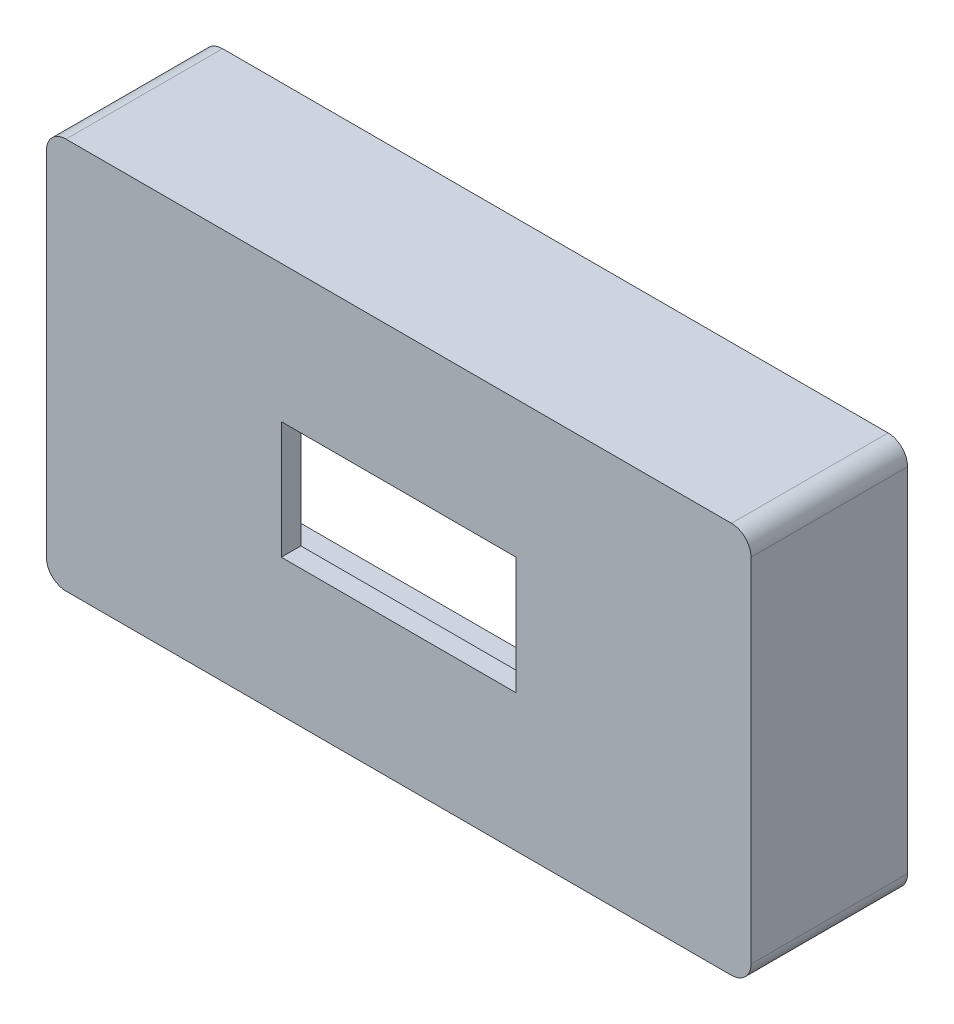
ISO-10303-21;
HEADER;
FILE_DESCRIPTION(('STEP AP214'),'2;1');
FILE_NAME('part.step','',(''),(''),'','','');
FILE_SCHEMA(('AUTOMOTIVE_DESIGN { 1 0 10303 214 1 1 1 1 }'));
ENDSEC;
DATA;
#1=APPLICATION_CONTEXT('core data for automotive mechanical design processes');
#2=APPLICATION_PROTOCOL_DEFINITION('international standard','automotive_design',2000,#1);
#3=PRODUCT_CONTEXT('',#1,'mechanical');
#4=PRODUCT('Part','Part','',(#3));
#5=PRODUCT_RELATED_PRODUCT_CATEGORY('part','',(#4));
#6=PRODUCT_DEFINITION_FORMATION('','',#4);
#7=PRODUCT_DEFINITION_CONTEXT('part definition',#1,'design');
#8=PRODUCT_DEFINITION('design','',#6,#7);
#9=PRODUCT_DEFINITION_SHAPE('','',#8);
#10=(LENGTH_UNIT() NAMED_UNIT(*) SI_UNIT(.MILLI.,.METRE.));
#11=(NAMED_UNIT(*) PLANE_ANGLE_UNIT() SI_UNIT($,.RADIAN.));
#12=(NAMED_UNIT(*) SI_UNIT($,.STERADIAN.) SOLID_ANGLE_UNIT());
#13=UNCERTAINTY_MEASURE_WITH_UNIT(LENGTH_MEASURE(1.E-05),#10,'distance_accuracy_value','');
#14=(GEOMETRIC_REPRESENTATION_CONTEXT(3) GLOBAL_UNCERTAINTY_ASSIGNED_CONTEXT((#13)) GLOBAL_UNIT_ASSIGNED_CONTEXT((#10,
#11,#12)) REPRESENTATION_CONTEXT('',''));
#15=CARTESIAN_POINT('',(0.,0.,0.));
#16=DIRECTION('',(0.,0.,1.));
#17=DIRECTION('',(1.,0.,0.));
#18=AXIS2_PLACEMENT_3D('',#15,#16,#17);
#19=CARTESIAN_POINT('',(43.18,22.86,0.));
#20=DIRECTION('',(0.,0.,-1.));
#21=DIRECTION('',(-1.,0.,0.));
#22=AXIS2_PLACEMENT_3D('',#19,#20,#21);
#23=PLANE('',#22);
#24=DIRECTION('',(0.,-1.,0.));
#25=VECTOR('',#24,1.);
#26=CARTESIAN_POINT('',(35.56,22.86,0.));
#27=LINE('',#26,#25);
#28=CARTESIAN_POINT('',(35.56,22.86,0.));
#29=VERTEX_POINT('',#28);
#30=CARTESIAN_POINT('',(35.56,-22.86,0.));
#31=VERTEX_POINT('',#30);
#32=EDGE_CURVE('E167',#29,#31,#27,.T.);
#33=ORIENTED_EDGE('',*,*,#32,.F.);
#34=DIRECTION('',(-1.,0.,0.));
#35=VECTOR('',#34,1.);
#36=CARTESIAN_POINT('',(43.18,22.86,0.));
#37=LINE('',#36,#35);
#38=CARTESIAN_POINT('',(-35.56,22.86,0.));
#39=VERTEX_POINT('',#38);
#40=EDGE_CURVE('E159',#29,#39,#37,.T.);
#41=ORIENTED_EDGE('',*,*,#40,.T.);
#42=DIRECTION('',(0.,-1.,0.));
#43=VECTOR('',#42,1.);
#44=CARTESIAN_POINT('',(-35.56,22.86,0.));
#45=LINE('',#44,#43);
#46=CARTESIAN_POINT('',(-35.56,-22.86,0.));
#47=VERTEX_POINT('',#46);
#48=EDGE_CURVE('E162',#39,#47,#45,.T.);
#49=ORIENTED_EDGE('',*,*,#48,.T.);
#50=DIRECTION('',(1.,0.,0.));
#51=VECTOR('',#50,1.);
#52=CARTESIAN_POINT('',(43.18,-22.86,0.));
#53=LINE('',#52,#51);
#54=EDGE_CURVE('E148',#47,#31,#53,.T.);
#55=ORIENTED_EDGE('',*,*,#54,.T.);
#56=EDGE_LOOP('',(#33,#41,#49,#55));
#57=FACE_BOUND('',#56,.T.);
#58=CARTESIAN_POINT('',(43.18,22.86,0.));
#59=DIRECTION('',(0.,0.,1.));
#60=DIRECTION('',(-1.,0.,0.));
#61=AXIS2_PLACEMENT_3D('',#58,#59,#60);
#62=CIRCLE('',#61,2.54);
#63=CARTESIAN_POINT('',(45.72,22.86,0.));
#64=VERTEX_POINT('',#63);
#65=CARTESIAN_POINT('',(43.18,25.4,0.));
#66=VERTEX_POINT('',#65);
#67=EDGE_CURVE('E212',#64,#66,#62,.T.);
#68=ORIENTED_EDGE('',*,*,#67,.F.);
#69=DIRECTION('',(0.,1.,0.));
#70=VECTOR('',#69,1.);
#71=CARTESIAN_POINT('',(45.72,22.86,0.));
#72=LINE('',#71,#70);
#73=CARTESIAN_POINT('',(45.72,-22.86,0.));
#74=VERTEX_POINT('',#73);
#75=EDGE_CURVE('E217',#74,#64,#72,.T.);
#76=ORIENTED_EDGE('',*,*,#75,.F.);
#77=CARTESIAN_POINT('',(43.18,-22.86,0.));
#78=DIRECTION('',(0.,0.,1.));
#79=DIRECTION('',(1.,0.,0.));
#80=AXIS2_PLACEMENT_3D('',#77,#78,#79);
#81=CIRCLE('',#80,2.54);
#82=CARTESIAN_POINT('',(43.18,-25.4,0.));
#83=VERTEX_POINT('',#82);
#84=EDGE_CURVE('E244',#83,#74,#81,.T.);
#85=ORIENTED_EDGE('',*,*,#84,.F.);
#86=DIRECTION('',(1.,0.,0.));
#87=VECTOR('',#86,1.);
#88=CARTESIAN_POINT('',(-43.18,-25.4,0.));
#89=LINE('',#88,#87);
#90=CARTESIAN_POINT('',(-43.18,-25.4,0.));
#91=VERTEX_POINT('',#90);
#92=EDGE_CURVE('E242',#91,#83,#89,.T.);
#93=ORIENTED_EDGE('',*,*,#92,.F.);
#94=CARTESIAN_POINT('',(-43.18,-22.86,0.));
#95=DIRECTION('',(0.,0.,1.));
#96=DIRECTION('',(1.,0.,0.));
#97=AXIS2_PLACEMENT_3D('',#94,#95,#96);
#98=CIRCLE('',#97,2.54);
#99=CARTESIAN_POINT('',(-45.72,-22.86,0.));
#100=VERTEX_POINT('',#99);
#101=EDGE_CURVE('E240',#100,#91,#98,.T.);
#102=ORIENTED_EDGE('',*,*,#101,.F.);
#103=DIRECTION('',(0.,-1.,0.));
#104=VECTOR('',#103,1.);
#105=CARTESIAN_POINT('',(-45.72,22.86,0.));
#106=LINE('',#105,#104);
#107=CARTESIAN_POINT('',(-45.72,22.86,0.));
#108=VERTEX_POINT('',#107);
#109=EDGE_CURVE('E238',#108,#100,#106,.T.);
#110=ORIENTED_EDGE('',*,*,#109,.F.);
#111=CARTESIAN_POINT('',(-43.18,22.86,0.));
#112=DIRECTION('',(0.,0.,1.));
#113=DIRECTION('',(1.,0.,0.));
#114=AXIS2_PLACEMENT_3D('',#111,#112,#113);
#115=CIRCLE('',#114,2.54);
#116=CARTESIAN_POINT('',(-43.18,25.4,0.));
#117=VERTEX_POINT('',#116);
#118=EDGE_CURVE('E236',#117,#108,#115,.T.);
#119=ORIENTED_EDGE('',*,*,#118,.F.);
#120=DIRECTION('',(-1.,0.,0.));
#121=VECTOR('',#120,1.);
#122=CARTESIAN_POINT('',(-43.18,25.4,0.));
#123=LINE('',#122,#121);
#124=EDGE_CURVE('E234',#66,#117,#123,.T.);
#125=ORIENTED_EDGE('',*,*,#124,.F.);
#126=EDGE_LOOP('',(#68,#76,#85,#93,#102,#110,#119,#125));
#127=FACE_BOUND('',#126,.T.);
#128=ADVANCED_FACE('F33',(#57,#127),#23,.T.);
#129=CARTESIAN_POINT('',(43.18,22.86,20.32));
#130=DIRECTION('',(0.,0.,-1.));
#131=DIRECTION('',(-1.,0.,0.));
#132=AXIS2_PLACEMENT_3D('',#129,#130,#131);
#133=PLANE('',#132);
#134=CARTESIAN_POINT('',(43.18,22.86,20.32));
#135=DIRECTION('',(0.,0.,1.));
#136=DIRECTION('',(-1.,0.,0.));
#137=AXIS2_PLACEMENT_3D('',#134,#135,#136);
#138=CIRCLE('',#137,2.54);
#139=CARTESIAN_POINT('',(45.72,22.86,20.32));
#140=VERTEX_POINT('',#139);
#141=CARTESIAN_POINT('',(43.18,25.4,20.32));
#142=VERTEX_POINT('',#141);
#143=EDGE_CURVE('E213',#140,#142,#138,.T.);
#144=ORIENTED_EDGE('',*,*,#143,.T.);
#145=DIRECTION('',(-1.,0.,0.));
#146=VECTOR('',#145,1.);
#147=CARTESIAN_POINT('',(-43.18,25.4,20.32));
#148=LINE('',#147,#146);
#149=CARTESIAN_POINT('',(-43.18,25.4,20.32));
#150=VERTEX_POINT('',#149);
#151=EDGE_CURVE('E216',#142,#150,#148,.T.);
#152=ORIENTED_EDGE('',*,*,#151,.T.);
#153=CARTESIAN_POINT('',(-43.18,22.86,20.32));
#154=DIRECTION('',(0.,0.,1.));
#155=DIRECTION('',(1.,0.,0.));
#156=AXIS2_PLACEMENT_3D('',#153,#154,#155);
#157=CIRCLE('',#156,2.54);
#158=CARTESIAN_POINT('',(-45.72,22.86,20.32));
#159=VERTEX_POINT('',#158);
#160=EDGE_CURVE('E219',#150,#159,#157,.T.);
#161=ORIENTED_EDGE('',*,*,#160,.T.);
#162=DIRECTION('',(0.,-1.,0.));
#163=VECTOR('',#162,1.);
#164=CARTESIAN_POINT('',(-45.72,22.86,20.32));
#165=LINE('',#164,#163);
#166=CARTESIAN_POINT('',(-45.72,-22.86,20.32));
#167=VERTEX_POINT('',#166);
#168=EDGE_CURVE('E221',#159,#167,#165,.T.);
#169=ORIENTED_EDGE('',*,*,#168,.T.);
#170=CARTESIAN_POINT('',(-43.18,-22.86,20.32));
#171=DIRECTION('',(0.,0.,1.));
#172=DIRECTION('',(1.,0.,0.));
#173=AXIS2_PLACEMENT_3D('',#170,#171,#172);
#174=CIRCLE('',#173,2.54);
#175=CARTESIAN_POINT('',(-43.18,-25.4,20.32));
#176=VERTEX_POINT('',#175);
#177=EDGE_CURVE('E223',#167,#176,#174,.T.);
#178=ORIENTED_EDGE('',*,*,#177,.T.);
#179=DIRECTION('',(1.,0.,0.));
#180=VECTOR('',#179,1.);
#181=CARTESIAN_POINT('',(-43.18,-25.4,20.32));
#182=LINE('',#181,#180);
#183=CARTESIAN_POINT('',(43.18,-25.4,20.32));
#184=VERTEX_POINT('',#183);
#185=EDGE_CURVE('E225',#176,#184,#182,.T.);
#186=ORIENTED_EDGE('',*,*,#185,.T.);
#187=CARTESIAN_POINT('',(43.18,-22.86,20.32));
#188=DIRECTION('',(0.,0.,1.));
#189=DIRECTION('',(1.,0.,0.));
#190=AXIS2_PLACEMENT_3D('',#187,#188,#189);
#191=CIRCLE('',#190,2.54);
#192=CARTESIAN_POINT('',(45.72,-22.86,20.32));
#193=VERTEX_POINT('',#192);
#194=EDGE_CURVE('E227',#184,#193,#191,.T.);
#195=ORIENTED_EDGE('',*,*,#194,.T.);
#196=DIRECTION('',(0.,1.,0.));
#197=VECTOR('',#196,1.);
#198=CARTESIAN_POINT('',(45.72,22.86,20.32));
#199=LINE('',#198,#197);
#200=EDGE_CURVE('E229',#193,#140,#199,.T.);
#201=ORIENTED_EDGE('',*,*,#200,.T.);
#202=EDGE_LOOP('',(#144,#152,#161,#169,#178,#186,#195,#201));
#203=FACE_BOUND('',#202,.T.);
#204=DIRECTION('',(0.,1.,0.));
#205=VECTOR('',#204,1.);
#206=CARTESIAN_POINT('',(15.24,7.62,20.32));
#207=LINE('',#206,#205);
#208=CARTESIAN_POINT('',(15.24,-7.62,20.32));
#209=VERTEX_POINT('',#208);
#210=CARTESIAN_POINT('',(15.24,7.62,20.32));
#211=VERTEX_POINT('',#210);
#212=EDGE_CURVE('E190',#209,#211,#207,.T.);
#213=ORIENTED_EDGE('',*,*,#212,.F.);
#214=DIRECTION('',(1.,0.,0.));
#215=VECTOR('',#214,1.);
#216=CARTESIAN_POINT('',(-15.24,-7.62,20.32));
#217=LINE('',#216,#215);
#218=CARTESIAN_POINT('',(-15.24,-7.62,20.32));
#219=VERTEX_POINT('',#218);
#220=EDGE_CURVE('E198',#219,#209,#217,.T.);
#221=ORIENTED_EDGE('',*,*,#220,.F.);
#222=DIRECTION('',(0.,-1.,0.));
#223=VECTOR('',#222,1.);
#224=CARTESIAN_POINT('',(-15.24,7.62,20.32));
#225=LINE('',#224,#223);
#226=CARTESIAN_POINT('',(-15.24,7.62,20.32));
#227=VERTEX_POINT('',#226);
#228=EDGE_CURVE('E195',#227,#219,#225,.T.);
#229=ORIENTED_EDGE('',*,*,#228,.F.);
#230=DIRECTION('',(-1.,0.,0.));
#231=VECTOR('',#230,1.);
#232=CARTESIAN_POINT('',(-15.24,7.62,20.32));
#233=LINE('',#232,#231);
#234=EDGE_CURVE('E193',#211,#227,#233,.T.);
#235=ORIENTED_EDGE('',*,*,#234,.F.);
#236=EDGE_LOOP('',(#213,#221,#229,#235));
#237=FACE_BOUND('',#236,.T.);
#238=ADVANCED_FACE('F285',(#203,#237),#133,.F.);
#239=CARTESIAN_POINT('',(43.18,22.86,20.32));
#240=DIRECTION('',(0.,0.,-1.));
#241=DIRECTION('',(-1.,0.,0.));
#242=AXIS2_PLACEMENT_3D('',#239,#240,#241);
#243=CYLINDRICAL_SURFACE('',#242,2.54);
#244=ORIENTED_EDGE('',*,*,#67,.T.);
#245=DIRECTION('',(0.,0.,-1.));
#246=VECTOR('',#245,1.);
#247=CARTESIAN_POINT('',(43.18,25.4,20.32));
#248=LINE('',#247,#246);
#249=EDGE_CURVE('E11',#142,#66,#248,.T.);
#250=ORIENTED_EDGE('',*,*,#249,.F.);
#251=ORIENTED_EDGE('',*,*,#143,.F.);
#252=DIRECTION('',(0.,0.,-1.));
#253=VECTOR('',#252,1.);
#254=CARTESIAN_POINT('',(45.72,22.86,20.32));
#255=LINE('',#254,#253);
#256=EDGE_CURVE('E231',#140,#64,#255,.T.);
#257=ORIENTED_EDGE('',*,*,#256,.T.);
#258=EDGE_LOOP('',(#244,#250,#251,#257));
#259=FACE_BOUND('',#258,.T.);
#260=ADVANCED_FACE('F35',(#259),#243,.T.);
#261=CARTESIAN_POINT('',(-43.18,25.4,20.32));
#262=DIRECTION('',(0.,-1.,0.));
#263=DIRECTION('',(0.,0.,-1.));
#264=AXIS2_PLACEMENT_3D('',#261,#262,#263);
#265=PLANE('',#264);
#266=ORIENTED_EDGE('',*,*,#124,.T.);
#267=DIRECTION('',(0.,0.,-1.));
#268=VECTOR('',#267,1.);
#269=CARTESIAN_POINT('',(-43.18,25.4,20.32));
#270=LINE('',#269,#268);
#271=EDGE_CURVE('E41',#150,#117,#270,.T.);
#272=ORIENTED_EDGE('',*,*,#271,.F.);
#273=ORIENTED_EDGE('',*,*,#151,.F.);
#274=ORIENTED_EDGE('',*,*,#249,.T.);
#275=EDGE_LOOP('',(#266,#272,#273,#274));
#276=FACE_BOUND('',#275,.T.);
#277=ADVANCED_FACE('F290',(#276),#265,.F.);
#278=CARTESIAN_POINT('',(-43.18,22.86,20.32));
#279=DIRECTION('',(0.,0.,-1.));
#280=DIRECTION('',(-1.,0.,0.));
#281=AXIS2_PLACEMENT_3D('',#278,#279,#280);
#282=CYLINDRICAL_SURFACE('',#281,2.54);
#283=ORIENTED_EDGE('',*,*,#118,.T.);
#284=DIRECTION('',(0.,0.,-1.));
#285=VECTOR('',#284,1.);
#286=CARTESIAN_POINT('',(-45.72,22.86,20.32));
#287=LINE('',#286,#285);
#288=EDGE_CURVE('E261',#159,#108,#287,.T.);
#289=ORIENTED_EDGE('',*,*,#288,.F.);
#290=ORIENTED_EDGE('',*,*,#160,.F.);
#291=ORIENTED_EDGE('',*,*,#271,.T.);
#292=EDGE_LOOP('',(#283,#289,#290,#291));
#293=FACE_BOUND('',#292,.T.);
#294=ADVANCED_FACE('F268',(#293),#282,.T.);
#295=CARTESIAN_POINT('',(-45.72,22.86,20.32));
#296=DIRECTION('',(1.,0.,0.));
#297=DIRECTION('',(0.,0.,-1.));
#298=AXIS2_PLACEMENT_3D('',#295,#296,#297);
#299=PLANE('',#298);
#300=ORIENTED_EDGE('',*,*,#109,.T.);
#301=DIRECTION('',(0.,0.,-1.));
#302=VECTOR('',#301,1.);
#303=CARTESIAN_POINT('',(-45.72,-22.86,20.32));
#304=LINE('',#303,#302);
#305=EDGE_CURVE('E258',#167,#100,#304,.T.);
#306=ORIENTED_EDGE('',*,*,#305,.F.);
#307=ORIENTED_EDGE('',*,*,#168,.F.);
#308=ORIENTED_EDGE('',*,*,#288,.T.);
#309=EDGE_LOOP('',(#300,#306,#307,#308));
#310=FACE_BOUND('',#309,.T.);
#311=ADVANCED_FACE('F277',(#310),#299,.F.);
#312=CARTESIAN_POINT('',(-43.18,-22.86,20.32));
#313=DIRECTION('',(0.,0.,-1.));
#314=DIRECTION('',(-1.,0.,0.));
#315=AXIS2_PLACEMENT_3D('',#312,#313,#314);
#316=CYLINDRICAL_SURFACE('',#315,2.54);
#317=ORIENTED_EDGE('',*,*,#101,.T.);
#318=DIRECTION('',(0.,0.,-1.));
#319=VECTOR('',#318,1.);
#320=CARTESIAN_POINT('',(-43.18,-25.4,20.32));
#321=LINE('',#320,#319);
#322=EDGE_CURVE('E255',#176,#91,#321,.T.);
#323=ORIENTED_EDGE('',*,*,#322,.F.);
#324=ORIENTED_EDGE('',*,*,#177,.F.);
#325=ORIENTED_EDGE('',*,*,#305,.T.);
#326=EDGE_LOOP('',(#317,#323,#324,#325));
#327=FACE_BOUND('',#326,.T.);
#328=ADVANCED_FACE('F281',(#327),#316,.T.);
#329=CARTESIAN_POINT('',(-43.18,-25.4,20.32));
#330=DIRECTION('',(0.,1.,0.));
#331=DIRECTION('',(0.,0.,1.));
#332=AXIS2_PLACEMENT_3D('',#329,#330,#331);
#333=PLANE('',#332);
#334=ORIENTED_EDGE('',*,*,#92,.T.);
#335=DIRECTION('',(0.,0.,-1.));
#336=VECTOR('',#335,1.);
#337=CARTESIAN_POINT('',(43.18,-25.4,20.32));
#338=LINE('',#337,#336);
#339=EDGE_CURVE('E252',#184,#83,#338,.T.);
#340=ORIENTED_EDGE('',*,*,#339,.F.);
#341=ORIENTED_EDGE('',*,*,#185,.F.);
#342=ORIENTED_EDGE('',*,*,#322,.T.);
#343=EDGE_LOOP('',(#334,#340,#341,#342));
#344=FACE_BOUND('',#343,.T.);
#345=ADVANCED_FACE('F303',(#344),#333,.F.);
#346=CARTESIAN_POINT('',(43.18,-22.86,20.32));
#347=DIRECTION('',(0.,0.,-1.));
#348=DIRECTION('',(-1.,0.,0.));
#349=AXIS2_PLACEMENT_3D('',#346,#347,#348);
#350=CYLINDRICAL_SURFACE('',#349,2.54);
#351=ORIENTED_EDGE('',*,*,#84,.T.);
#352=DIRECTION('',(0.,0.,-1.));
#353=VECTOR('',#352,1.);
#354=CARTESIAN_POINT('',(45.72,-22.86,20.32));
#355=LINE('',#354,#353);
#356=EDGE_CURVE('E249',#193,#74,#355,.T.);
#357=ORIENTED_EDGE('',*,*,#356,.F.);
#358=ORIENTED_EDGE('',*,*,#194,.F.);
#359=ORIENTED_EDGE('',*,*,#339,.T.);
#360=EDGE_LOOP('',(#351,#357,#358,#359));
#361=FACE_BOUND('',#360,.T.);
#362=ADVANCED_FACE('F301',(#361),#350,.T.);
#363=CARTESIAN_POINT('',(45.72,22.86,20.32));
#364=DIRECTION('',(-1.,0.,0.));
#365=DIRECTION('',(0.,-1.,0.));
#366=AXIS2_PLACEMENT_3D('',#363,#364,#365);
#367=PLANE('',#366);
#368=ORIENTED_EDGE('',*,*,#75,.T.);
#369=ORIENTED_EDGE('',*,*,#256,.F.);
#370=ORIENTED_EDGE('',*,*,#200,.F.);
#371=ORIENTED_EDGE('',*,*,#356,.T.);
#372=EDGE_LOOP('',(#368,#369,#370,#371));
#373=FACE_BOUND('',#372,.T.);
#374=ADVANCED_FACE('F296',(#373),#367,.F.);
#375=CARTESIAN_POINT('',(15.24,7.62,20.32));
#376=DIRECTION('',(-1.,0.,0.));
#377=DIRECTION('',(0.,-1.,0.));
#378=AXIS2_PLACEMENT_3D('',#375,#376,#377);
#379=PLANE('',#378);
#380=DIRECTION('',(0.,1.,0.));
#381=VECTOR('',#380,1.);
#382=CARTESIAN_POINT('',(15.24,7.62,17.78));
#383=LINE('',#382,#381);
#384=CARTESIAN_POINT('',(15.24,-7.62,17.78));
#385=VERTEX_POINT('',#384);
#386=CARTESIAN_POINT('',(15.24,7.62,17.78));
#387=VERTEX_POINT('',#386);
#388=EDGE_CURVE('E183',#385,#387,#383,.T.);
#389=ORIENTED_EDGE('',*,*,#388,.F.);
#390=DIRECTION('',(0.,0.,-1.));
#391=VECTOR('',#390,1.);
#392=CARTESIAN_POINT('',(15.24,-7.62,20.32));
#393=LINE('',#392,#391);
#394=EDGE_CURVE('E200',#209,#385,#393,.T.);
#395=ORIENTED_EDGE('',*,*,#394,.F.);
#396=ORIENTED_EDGE('',*,*,#212,.T.);
#397=DIRECTION('',(0.,0.,-1.));
#398=VECTOR('',#397,1.);
#399=CARTESIAN_POINT('',(15.24,7.62,20.32));
#400=LINE('',#399,#398);
#401=EDGE_CURVE('E209',#211,#387,#400,.T.);
#402=ORIENTED_EDGE('',*,*,#401,.T.);
#403=EDGE_LOOP('',(#389,#395,#396,#402));
#404=FACE_BOUND('',#403,.T.);
#405=ADVANCED_FACE('F321',(#404),#379,.T.);
#406=CARTESIAN_POINT('',(-15.24,7.62,20.32));
#407=DIRECTION('',(0.,-1.,0.));
#408=DIRECTION('',(0.,0.,-1.));
#409=AXIS2_PLACEMENT_3D('',#406,#407,#408);
#410=PLANE('',#409);
#411=DIRECTION('',(0.,0.,-1.));
#412=VECTOR('',#411,1.);
#413=CARTESIAN_POINT('',(-15.24,7.62,20.32));
#414=LINE('',#413,#412);
#415=CARTESIAN_POINT('',(-15.24,7.62,17.78));
#416=VERTEX_POINT('',#415);
#417=EDGE_CURVE('E206',#227,#416,#414,.T.);
#418=ORIENTED_EDGE('',*,*,#417,.T.);
#419=DIRECTION('',(-1.,0.,0.));
#420=VECTOR('',#419,1.);
#421=CARTESIAN_POINT('',(-15.24,7.62,17.78));
#422=LINE('',#421,#420);
#423=EDGE_CURVE('E185',#387,#416,#422,.T.);
#424=ORIENTED_EDGE('',*,*,#423,.F.);
#425=ORIENTED_EDGE('',*,*,#401,.F.);
#426=ORIENTED_EDGE('',*,*,#234,.T.);
#427=EDGE_LOOP('',(#418,#424,#425,#426));
#428=FACE_BOUND('',#427,.T.);
#429=ADVANCED_FACE('F325',(#428),#410,.T.);
#430=CARTESIAN_POINT('',(-15.24,7.62,20.32));
#431=DIRECTION('',(1.,0.,0.));
#432=DIRECTION('',(0.,0.,-1.));
#433=AXIS2_PLACEMENT_3D('',#430,#431,#432);
#434=PLANE('',#433);
#435=DIRECTION('',(0.,-1.,0.));
#436=VECTOR('',#435,1.);
#437=CARTESIAN_POINT('',(-15.24,7.62,17.78));
#438=LINE('',#437,#436);
#439=CARTESIAN_POINT('',(-15.24,-7.62,17.78));
#440=VERTEX_POINT('',#439);
#441=EDGE_CURVE('E178',#416,#440,#438,.T.);
#442=ORIENTED_EDGE('',*,*,#441,.F.);
#443=ORIENTED_EDGE('',*,*,#417,.F.);
#444=ORIENTED_EDGE('',*,*,#228,.T.);
#445=DIRECTION('',(0.,0.,-1.));
#446=VECTOR('',#445,1.);
#447=CARTESIAN_POINT('',(-15.24,-7.62,20.32));
#448=LINE('',#447,#446);
#449=EDGE_CURVE('E203',#219,#440,#448,.T.);
#450=ORIENTED_EDGE('',*,*,#449,.T.);
#451=EDGE_LOOP('',(#442,#443,#444,#450));
#452=FACE_BOUND('',#451,.T.);
#453=ADVANCED_FACE('F330',(#452),#434,.T.);
#454=CARTESIAN_POINT('',(-15.24,-7.62,20.32));
#455=DIRECTION('',(0.,1.,0.));
#456=DIRECTION('',(0.,0.,1.));
#457=AXIS2_PLACEMENT_3D('',#454,#455,#456);
#458=PLANE('',#457);
#459=DIRECTION('',(1.,0.,0.));
#460=VECTOR('',#459,1.);
#461=CARTESIAN_POINT('',(-15.24,-7.62,17.78));
#462=LINE('',#461,#460);
#463=EDGE_CURVE('E181',#440,#385,#462,.T.);
#464=ORIENTED_EDGE('',*,*,#463,.F.);
#465=ORIENTED_EDGE('',*,*,#449,.F.);
#466=ORIENTED_EDGE('',*,*,#220,.T.);
#467=ORIENTED_EDGE('',*,*,#394,.T.);
#468=EDGE_LOOP('',(#464,#465,#466,#467));
#469=FACE_BOUND('',#468,.T.);
#470=ADVANCED_FACE('F337',(#469),#458,.T.);
#471=CARTESIAN_POINT('',(43.18,22.86,17.78));
#472=DIRECTION('',(0.,0.,-1.));
#473=DIRECTION('',(-1.,0.,0.));
#474=AXIS2_PLACEMENT_3D('',#471,#472,#473);
#475=PLANE('',#474);
#476=DIRECTION('',(0.,1.,0.));
#477=VECTOR('',#476,1.);
#478=CARTESIAN_POINT('',(-35.56,22.86,17.78));
#479=LINE('',#478,#477);
#480=CARTESIAN_POINT('',(-35.56,-22.86,17.78));
#481=VERTEX_POINT('',#480);
#482=CARTESIAN_POINT('',(-35.56,22.86,17.78));
#483=VERTEX_POINT('',#482);
#484=EDGE_CURVE('E56',#481,#483,#479,.T.);
#485=ORIENTED_EDGE('',*,*,#484,.T.);
#486=DIRECTION('',(-1.,0.,0.));
#487=VECTOR('',#486,1.);
#488=CARTESIAN_POINT('',(43.18,22.86,17.78));
#489=LINE('',#488,#487);
#490=CARTESIAN_POINT('',(35.56,22.86,17.78));
#491=VERTEX_POINT('',#490);
#492=EDGE_CURVE('E158',#491,#483,#489,.T.);
#493=ORIENTED_EDGE('',*,*,#492,.F.);
#494=DIRECTION('',(0.,1.,0.));
#495=VECTOR('',#494,1.);
#496=CARTESIAN_POINT('',(35.56,22.86,17.78));
#497=LINE('',#496,#495);
#498=CARTESIAN_POINT('',(35.56,-22.86,17.78));
#499=VERTEX_POINT('',#498);
#500=EDGE_CURVE('E174',#499,#491,#497,.T.);
#501=ORIENTED_EDGE('',*,*,#500,.F.);
#502=DIRECTION('',(1.,0.,0.));
#503=VECTOR('',#502,1.);
#504=CARTESIAN_POINT('',(43.18,-22.86,17.78));
#505=LINE('',#504,#503);
#506=EDGE_CURVE('E188',#481,#499,#505,.T.);
#507=ORIENTED_EDGE('',*,*,#506,.F.);
#508=EDGE_LOOP('',(#485,#493,#501,#507));
#509=FACE_BOUND('',#508,.T.);
#510=ORIENTED_EDGE('',*,*,#423,.T.);
#511=ORIENTED_EDGE('',*,*,#441,.T.);
#512=ORIENTED_EDGE('',*,*,#463,.T.);
#513=ORIENTED_EDGE('',*,*,#388,.T.);
#514=EDGE_LOOP('',(#510,#511,#512,#513));
#515=FACE_BOUND('',#514,.T.);
#516=ADVANCED_FACE('F341',(#509,#515),#475,.T.);
#517=CARTESIAN_POINT('',(-43.18,22.86,20.32));
#518=DIRECTION('',(0.,-1.,0.));
#519=DIRECTION('',(0.,0.,-1.));
#520=AXIS2_PLACEMENT_3D('',#517,#518,#519);
#521=PLANE('',#520);
#522=DIRECTION('',(0.,0.,-1.));
#523=VECTOR('',#522,1.);
#524=CARTESIAN_POINT('',(-35.56,22.86,0.));
#525=LINE('',#524,#523);
#526=EDGE_CURVE('E48',#483,#39,#525,.T.);
#527=ORIENTED_EDGE('',*,*,#526,.T.);
#528=ORIENTED_EDGE('',*,*,#40,.F.);
#529=DIRECTION('',(0.,0.,-1.));
#530=VECTOR('',#529,1.);
#531=CARTESIAN_POINT('',(35.56,22.86,0.));
#532=LINE('',#531,#530);
#533=EDGE_CURVE('E176',#491,#29,#532,.T.);
#534=ORIENTED_EDGE('',*,*,#533,.F.);
#535=ORIENTED_EDGE('',*,*,#492,.T.);
#536=EDGE_LOOP('',(#527,#528,#534,#535));
#537=FACE_BOUND('',#536,.T.);
#538=ADVANCED_FACE('F346',(#537),#521,.T.);
#539=CARTESIAN_POINT('',(-43.18,-22.86,20.32));
#540=DIRECTION('',(0.,1.,0.));
#541=DIRECTION('',(0.,0.,1.));
#542=AXIS2_PLACEMENT_3D('',#539,#540,#541);
#543=PLANE('',#542);
#544=DIRECTION('',(0.,0.,1.));
#545=VECTOR('',#544,1.);
#546=CARTESIAN_POINT('',(-35.56,-22.86,0.));
#547=LINE('',#546,#545);
#548=EDGE_CURVE('E152',#47,#481,#547,.T.);
#549=ORIENTED_EDGE('',*,*,#548,.T.);
#550=ORIENTED_EDGE('',*,*,#506,.T.);
#551=DIRECTION('',(0.,0.,1.));
#552=VECTOR('',#551,1.);
#553=CARTESIAN_POINT('',(35.56,-22.86,0.));
#554=LINE('',#553,#552);
#555=EDGE_CURVE('E154',#31,#499,#554,.T.);
#556=ORIENTED_EDGE('',*,*,#555,.F.);
#557=ORIENTED_EDGE('',*,*,#54,.F.);
#558=EDGE_LOOP('',(#549,#550,#556,#557));
#559=FACE_BOUND('',#558,.T.);
#560=ADVANCED_FACE('F150',(#559),#543,.T.);
#561=CARTESIAN_POINT('',(35.56,0.,0.));
#562=DIRECTION('',(-1.,0.,0.));
#563=DIRECTION('',(0.,0.,1.));
#564=AXIS2_PLACEMENT_3D('',#561,#562,#563);
#565=PLANE('',#564);
#566=ORIENTED_EDGE('',*,*,#32,.T.);
#567=ORIENTED_EDGE('',*,*,#555,.T.);
#568=ORIENTED_EDGE('',*,*,#500,.T.);
#569=ORIENTED_EDGE('',*,*,#533,.T.);
#570=EDGE_LOOP('',(#566,#567,#568,#569));
#571=FACE_BOUND('',#570,.T.);
#572=ADVANCED_FACE('F345',(#571),#565,.T.);
#573=CARTESIAN_POINT('',(-35.56,0.,0.));
#574=DIRECTION('',(1.,0.,0.));
#575=DIRECTION('',(0.,0.,1.));
#576=AXIS2_PLACEMENT_3D('',#573,#574,#575);
#577=PLANE('',#576);
#578=ORIENTED_EDGE('',*,*,#48,.F.);
#579=ORIENTED_EDGE('',*,*,#526,.F.);
#580=ORIENTED_EDGE('',*,*,#484,.F.);
#581=ORIENTED_EDGE('',*,*,#548,.F.);
#582=EDGE_LOOP('',(#578,#579,#580,#581));
#583=FACE_BOUND('',#582,.T.);
#584=ADVANCED_FACE('F166',(#583),#577,.T.);
#585=CLOSED_SHELL('',(#128,#238,#260,#277,#294,#311,#328,#345,#362,#374,#405,#429,#453,#470,
#516,#538,#560,#572,#584));
#586=MANIFOLD_SOLID_BREP('B2',#585);
#587=ADVANCED_BREP_SHAPE_REPRESENTATION('',(#18,#586),#14);
#588=SHAPE_DEFINITION_REPRESENTATION(#9,#587);
ENDSEC;
END-ISO-10303-21;
